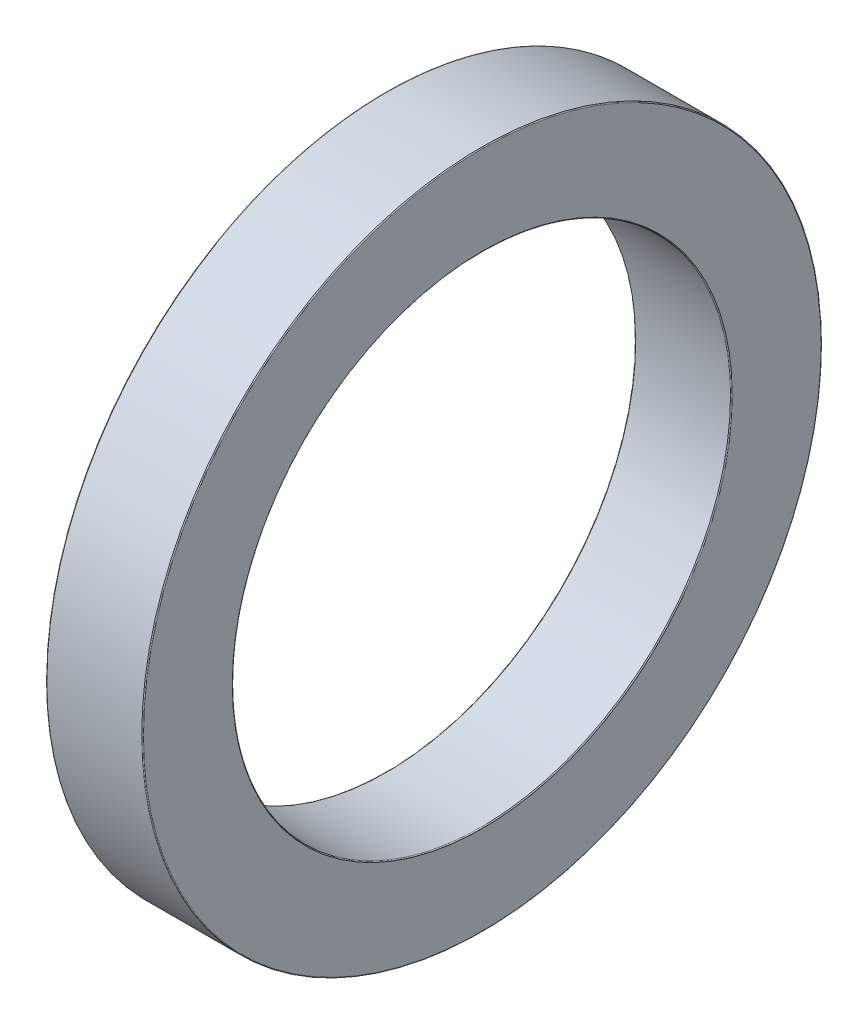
ISO-10303-21;
HEADER;
FILE_DESCRIPTION(('STEP AP214'),'2;1');
FILE_NAME('part.step','',(''),(''),'','','');
FILE_SCHEMA(('AUTOMOTIVE_DESIGN { 1 0 10303 214 1 1 1 1 }'));
ENDSEC;
DATA;
#1=APPLICATION_CONTEXT('core data for automotive mechanical design processes');
#2=APPLICATION_PROTOCOL_DEFINITION('international standard','automotive_design',2000,#1);
#3=PRODUCT_CONTEXT('',#1,'mechanical');
#4=PRODUCT('Part','Part','',(#3));
#5=PRODUCT_RELATED_PRODUCT_CATEGORY('part','',(#4));
#6=PRODUCT_DEFINITION_FORMATION('','',#4);
#7=PRODUCT_DEFINITION_CONTEXT('part definition',#1,'design');
#8=PRODUCT_DEFINITION('design','',#6,#7);
#9=PRODUCT_DEFINITION_SHAPE('','',#8);
#10=(LENGTH_UNIT() NAMED_UNIT(*) SI_UNIT(.MILLI.,.METRE.));
#11=(NAMED_UNIT(*) PLANE_ANGLE_UNIT() SI_UNIT($,.RADIAN.));
#12=(NAMED_UNIT(*) SI_UNIT($,.STERADIAN.) SOLID_ANGLE_UNIT());
#13=UNCERTAINTY_MEASURE_WITH_UNIT(LENGTH_MEASURE(1.E-05),#10,'distance_accuracy_value','');
#14=(GEOMETRIC_REPRESENTATION_CONTEXT(3) GLOBAL_UNCERTAINTY_ASSIGNED_CONTEXT((#13)) GLOBAL_UNIT_ASSIGNED_CONTEXT((#10,
#11,#12)) REPRESENTATION_CONTEXT('',''));
#15=CARTESIAN_POINT('',(0.,0.,0.));
#16=DIRECTION('',(0.,0.,1.));
#17=DIRECTION('',(1.,0.,0.));
#18=AXIS2_PLACEMENT_3D('',#15,#16,#17);
#19=CARTESIAN_POINT('',(20.,48.75,0.));
#20=DIRECTION('',(1.,0.,0.));
#21=DIRECTION('',(0.,0.,-1.));
#22=AXIS2_PLACEMENT_3D('',#19,#20,#21);
#23=PLANE('',#22);
#24=CARTESIAN_POINT('',(20.,0.,0.));
#25=DIRECTION('',(1.,0.,0.));
#26=DIRECTION('',(0.,0.,-1.));
#27=AXIS2_PLACEMENT_3D('',#24,#25,#26);
#28=CIRCLE('',#27,41.4);
#29=CARTESIAN_POINT('',(20.,0.,-41.4));
#30=VERTEX_POINT('',#29);
#31=CARTESIAN_POINT('',(20.,41.4,0.));
#32=VERTEX_POINT('',#31);
#33=EDGE_CURVE('E171',#30,#32,#28,.T.);
#34=ORIENTED_EDGE('',*,*,#33,.F.);
#35=CARTESIAN_POINT('',(20.,0.,0.));
#36=DIRECTION('',(1.,0.,0.));
#37=DIRECTION('',(0.,0.,1.));
#38=AXIS2_PLACEMENT_3D('',#35,#36,#37);
#39=CIRCLE('',#38,41.4);
#40=CARTESIAN_POINT('',(20.,0.,41.4));
#41=VERTEX_POINT('',#40);
#42=EDGE_CURVE('E79',#41,#30,#39,.T.);
#43=ORIENTED_EDGE('',*,*,#42,.F.);
#44=CARTESIAN_POINT('',(20.,0.,0.));
#45=DIRECTION('',(1.,0.,0.));
#46=DIRECTION('',(0.,1.,0.));
#47=AXIS2_PLACEMENT_3D('',#44,#45,#46);
#48=CIRCLE('',#47,41.4);
#49=EDGE_CURVE('E172',#32,#41,#48,.T.);
#50=ORIENTED_EDGE('',*,*,#49,.F.);
#51=EDGE_LOOP('',(#34,#43,#50));
#52=FACE_BOUND('',#51,.T.);
#53=CARTESIAN_POINT('',(20.,0.,0.));
#54=DIRECTION('',(-1.,0.,0.));
#55=DIRECTION('',(0.,0.,-1.));
#56=AXIS2_PLACEMENT_3D('',#53,#54,#55);
#57=CIRCLE('',#56,56.1);
#58=CARTESIAN_POINT('',(20.,0.,-56.1));
#59=VERTEX_POINT('',#58);
#60=CARTESIAN_POINT('',(20.,0.,56.1));
#61=VERTEX_POINT('',#60);
#62=EDGE_CURVE('E66',#59,#61,#57,.T.);
#63=ORIENTED_EDGE('',*,*,#62,.F.);
#64=CARTESIAN_POINT('',(20.,0.,0.));
#65=DIRECTION('',(-1.,0.,0.));
#66=DIRECTION('',(0.,1.,0.));
#67=AXIS2_PLACEMENT_3D('',#64,#65,#66);
#68=CIRCLE('',#67,56.1);
#69=CARTESIAN_POINT('',(20.,56.1,0.));
#70=VERTEX_POINT('',#69);
#71=EDGE_CURVE('E70',#70,#59,#68,.T.);
#72=ORIENTED_EDGE('',*,*,#71,.F.);
#73=CARTESIAN_POINT('',(20.,0.,0.));
#74=DIRECTION('',(-1.,0.,0.));
#75=DIRECTION('',(0.,0.,1.));
#76=AXIS2_PLACEMENT_3D('',#73,#74,#75);
#77=CIRCLE('',#76,56.1);
#78=EDGE_CURVE('E72',#61,#70,#77,.T.);
#79=ORIENTED_EDGE('',*,*,#78,.F.);
#80=EDGE_LOOP('',(#63,#72,#79));
#81=FACE_BOUND('',#80,.T.);
#82=ADVANCED_FACE('F16',(#52,#81),#23,.T.);
#83=CARTESIAN_POINT('',(19.85,0.,0.));
#84=DIRECTION('',(1.,0.,0.));
#85=DIRECTION('',(0.,0.,-1.));
#86=AXIS2_PLACEMENT_3D('',#83,#84,#85);
#87=TOROIDAL_SURFACE('',#86,56.1,0.15);
#88=CARTESIAN_POINT('',(19.85,0.,0.));
#89=DIRECTION('',(1.,0.,0.));
#90=DIRECTION('',(0.,0.,-1.));
#91=AXIS2_PLACEMENT_3D('',#88,#89,#90);
#92=CIRCLE('',#91,56.25);
#93=CARTESIAN_POINT('',(19.85,0.,-56.25));
#94=VERTEX_POINT('',#93);
#95=EDGE_CURVE('E208',#94,#94,#92,.F.);
#96=ORIENTED_EDGE('',*,*,#95,.F.);
#97=EDGE_LOOP('',(#96));
#98=FACE_BOUND('',#97,.T.);
#99=ORIENTED_EDGE('',*,*,#78,.T.);
#100=ORIENTED_EDGE('',*,*,#71,.T.);
#101=ORIENTED_EDGE('',*,*,#62,.T.);
#102=EDGE_LOOP('',(#99,#100,#101));
#103=FACE_BOUND('',#102,.T.);
#104=ADVANCED_FACE('F77',(#98,#103),#87,.T.);
#105=CARTESIAN_POINT('',(19.85,0.,0.));
#106=DIRECTION('',(1.,0.,0.));
#107=DIRECTION('',(0.,0.,-1.));
#108=AXIS2_PLACEMENT_3D('',#105,#106,#107);
#109=TOROIDAL_SURFACE('',#108,41.4,0.15);
#110=ORIENTED_EDGE('',*,*,#42,.T.);
#111=ORIENTED_EDGE('',*,*,#33,.T.);
#112=ORIENTED_EDGE('',*,*,#49,.T.);
#113=EDGE_LOOP('',(#110,#111,#112));
#114=FACE_BOUND('',#113,.T.);
#115=CARTESIAN_POINT('',(19.85,0.,0.));
#116=DIRECTION('',(1.,0.,0.));
#117=DIRECTION('',(0.,0.,-1.));
#118=AXIS2_PLACEMENT_3D('',#115,#116,#117);
#119=CIRCLE('',#118,41.25);
#120=CARTESIAN_POINT('',(19.85,0.,-41.25));
#121=VERTEX_POINT('',#120);
#122=EDGE_CURVE('E210',#121,#121,#119,.F.);
#123=ORIENTED_EDGE('',*,*,#122,.T.);
#124=EDGE_LOOP('',(#123));
#125=FACE_BOUND('',#124,.T.);
#126=ADVANCED_FACE('F98',(#114,#125),#109,.T.);
#127=CARTESIAN_POINT('',(12.,0.,0.));
#128=DIRECTION('',(1.,0.,0.));
#129=DIRECTION('',(0.,0.,-1.));
#130=AXIS2_PLACEMENT_3D('',#127,#128,#129);
#131=CYLINDRICAL_SURFACE('',#130,56.25);
#132=CARTESIAN_POINT('',(4.15,0.,0.));
#133=DIRECTION('',(1.,0.,0.));
#134=DIRECTION('',(0.,0.,-1.));
#135=AXIS2_PLACEMENT_3D('',#132,#133,#134);
#136=CIRCLE('',#135,56.25);
#137=CARTESIAN_POINT('',(4.15,0.,-56.25));
#138=VERTEX_POINT('',#137);
#139=EDGE_CURVE('E215',#138,#138,#136,.F.);
#140=ORIENTED_EDGE('',*,*,#139,.F.);
#141=EDGE_LOOP('',(#140));
#142=FACE_BOUND('',#141,.T.);
#143=ORIENTED_EDGE('',*,*,#95,.T.);
#144=EDGE_LOOP('',(#143));
#145=FACE_BOUND('',#144,.T.);
#146=ADVANCED_FACE('F291',(#142,#145),#131,.T.);
#147=CARTESIAN_POINT('',(12.,0.,0.));
#148=DIRECTION('',(1.,0.,0.));
#149=DIRECTION('',(0.,0.,-1.));
#150=AXIS2_PLACEMENT_3D('',#147,#148,#149);
#151=CYLINDRICAL_SURFACE('',#150,41.25);
#152=ORIENTED_EDGE('',*,*,#122,.F.);
#153=EDGE_LOOP('',(#152));
#154=FACE_BOUND('',#153,.T.);
#155=CARTESIAN_POINT('',(4.15,0.,0.));
#156=DIRECTION('',(1.,0.,0.));
#157=DIRECTION('',(0.,0.,-1.));
#158=AXIS2_PLACEMENT_3D('',#155,#156,#157);
#159=CIRCLE('',#158,41.25);
#160=CARTESIAN_POINT('',(4.15,0.,-41.25));
#161=VERTEX_POINT('',#160);
#162=EDGE_CURVE('E227',#161,#161,#159,.T.);
#163=ORIENTED_EDGE('',*,*,#162,.F.);
#164=EDGE_LOOP('',(#163));
#165=FACE_BOUND('',#164,.T.);
#166=ADVANCED_FACE('F123',(#154,#165),#151,.F.);
#167=CARTESIAN_POINT('',(4.15,0.,0.));
#168=DIRECTION('',(1.,0.,0.));
#169=DIRECTION('',(0.,0.,-1.));
#170=AXIS2_PLACEMENT_3D('',#167,#168,#169);
#171=TOROIDAL_SURFACE('',#170,56.1,0.15);
#172=ORIENTED_EDGE('',*,*,#139,.T.);
#173=EDGE_LOOP('',(#172));
#174=FACE_BOUND('',#173,.T.);
#175=CARTESIAN_POINT('',(4.,0.,0.));
#176=DIRECTION('',(1.,0.,0.));
#177=DIRECTION('',(0.,0.,1.));
#178=AXIS2_PLACEMENT_3D('',#175,#176,#177);
#179=CIRCLE('',#178,56.1);
#180=CARTESIAN_POINT('',(4.,0.,-56.1));
#181=VERTEX_POINT('',#180);
#182=CARTESIAN_POINT('',(4.,0.,56.1));
#183=VERTEX_POINT('',#182);
#184=EDGE_CURVE('E234',#181,#183,#179,.F.);
#185=ORIENTED_EDGE('',*,*,#184,.F.);
#186=CARTESIAN_POINT('',(4.,0.,0.));
#187=DIRECTION('',(1.,0.,0.));
#188=DIRECTION('',(0.,0.,-1.));
#189=AXIS2_PLACEMENT_3D('',#186,#187,#188);
#190=CIRCLE('',#189,56.1);
#191=CARTESIAN_POINT('',(4.,56.1,0.));
#192=VERTEX_POINT('',#191);
#193=EDGE_CURVE('E231',#192,#181,#190,.F.);
#194=ORIENTED_EDGE('',*,*,#193,.F.);
#195=CARTESIAN_POINT('',(4.,0.,0.));
#196=DIRECTION('',(1.,0.,0.));
#197=DIRECTION('',(0.,1.,0.));
#198=AXIS2_PLACEMENT_3D('',#195,#196,#197);
#199=CIRCLE('',#198,56.1);
#200=EDGE_CURVE('E148',#183,#192,#199,.F.);
#201=ORIENTED_EDGE('',*,*,#200,.F.);
#202=EDGE_LOOP('',(#185,#194,#201));
#203=FACE_BOUND('',#202,.T.);
#204=ADVANCED_FACE('F118',(#174,#203),#171,.T.);
#205=CARTESIAN_POINT('',(4.15,0.,0.));
#206=DIRECTION('',(1.,0.,0.));
#207=DIRECTION('',(0.,0.,-1.));
#208=AXIS2_PLACEMENT_3D('',#205,#206,#207);
#209=TOROIDAL_SURFACE('',#208,41.4,0.15);
#210=ORIENTED_EDGE('',*,*,#162,.T.);
#211=EDGE_LOOP('',(#210));
#212=FACE_BOUND('',#211,.T.);
#213=CARTESIAN_POINT('',(4.,0.,0.));
#214=DIRECTION('',(-1.,0.,0.));
#215=DIRECTION('',(0.,0.,1.));
#216=AXIS2_PLACEMENT_3D('',#213,#214,#215);
#217=CIRCLE('',#216,41.4);
#218=CARTESIAN_POINT('',(4.,41.4,0.));
#219=VERTEX_POINT('',#218);
#220=CARTESIAN_POINT('',(4.,0.,41.4));
#221=VERTEX_POINT('',#220);
#222=EDGE_CURVE('E236',#219,#221,#217,.F.);
#223=ORIENTED_EDGE('',*,*,#222,.F.);
#224=CARTESIAN_POINT('',(4.,0.,0.));
#225=DIRECTION('',(-1.,0.,0.));
#226=DIRECTION('',(0.,1.,0.));
#227=AXIS2_PLACEMENT_3D('',#224,#225,#226);
#228=CIRCLE('',#227,41.4);
#229=CARTESIAN_POINT('',(4.,0.,-41.4));
#230=VERTEX_POINT('',#229);
#231=EDGE_CURVE('E10',#230,#219,#228,.F.);
#232=ORIENTED_EDGE('',*,*,#231,.F.);
#233=CARTESIAN_POINT('',(4.,0.,0.));
#234=DIRECTION('',(-1.,0.,0.));
#235=DIRECTION('',(0.,0.,-1.));
#236=AXIS2_PLACEMENT_3D('',#233,#234,#235);
#237=CIRCLE('',#236,41.4);
#238=EDGE_CURVE('E29',#221,#230,#237,.F.);
#239=ORIENTED_EDGE('',*,*,#238,.F.);
#240=EDGE_LOOP('',(#223,#232,#239));
#241=FACE_BOUND('',#240,.T.);
#242=ADVANCED_FACE('F122',(#212,#241),#209,.T.);
#243=CARTESIAN_POINT('',(4.,52.425,0.));
#244=DIRECTION('',(-1.,0.,0.));
#245=DIRECTION('',(0.,0.,1.));
#246=AXIS2_PLACEMENT_3D('',#243,#244,#245);
#247=PLANE('',#246);
#248=ORIENTED_EDGE('',*,*,#238,.T.);
#249=ORIENTED_EDGE('',*,*,#231,.T.);
#250=ORIENTED_EDGE('',*,*,#222,.T.);
#251=EDGE_LOOP('',(#248,#249,#250));
#252=FACE_BOUND('',#251,.T.);
#253=ORIENTED_EDGE('',*,*,#193,.T.);
#254=ORIENTED_EDGE('',*,*,#184,.T.);
#255=ORIENTED_EDGE('',*,*,#200,.T.);
#256=EDGE_LOOP('',(#253,#254,#255));
#257=FACE_BOUND('',#256,.T.);
#258=ADVANCED_FACE('F18',(#252,#257),#247,.T.);
#259=CLOSED_SHELL('',(#82,#104,#126,#146,#166,#204,#242,#258));
#260=MANIFOLD_SOLID_BREP('B1',#259);
#261=ADVANCED_BREP_SHAPE_REPRESENTATION('',(#18,#260),#14);
#262=SHAPE_DEFINITION_REPRESENTATION(#9,#261);
ENDSEC;
END-ISO-10303-21;
